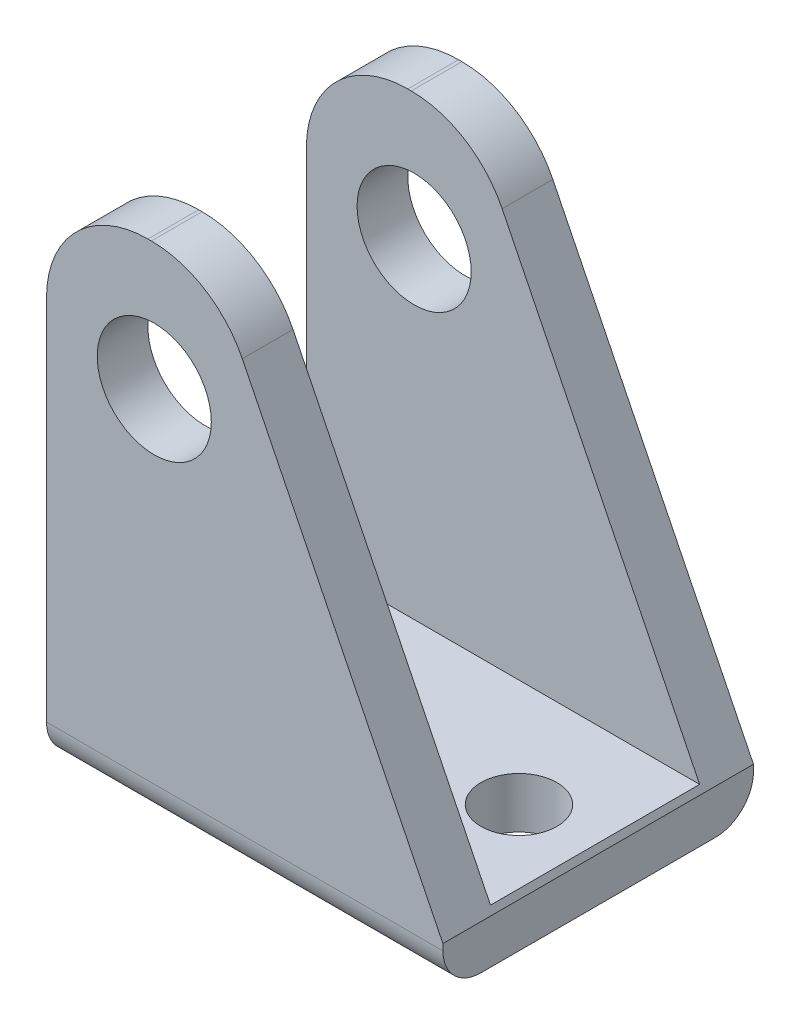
from build123d import *

# Parameters (mm, degrees)
EXTRUSION1_DEPTH        = 24.5
CONG_1_R                = 8
CONG_2_R                = 3
ESQUISSE3_R             = 4.5
ENL_V_MAT_EXTRU_1_DEPTH = 58.351983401
ESQUISSE4_W             = 36.682222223
ESQUISSE4_H             = 16.5
ENL_V_MAT_EXTRU_2_DEPTH = 36
ESQUISSE5_W             = 2.984444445
ESQUISSE5_H             = 26.595555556
ENL_V_MAT_EXTRU_3_DEPTH = 36
ESQUISSE6_R             = 3
ENL_V_MAT_EXTRU_4_DEPTH = 36


with BuildPart() as part:
    # Esquisse1 → Extrusion1 (new body)
    with BuildSketch(Plane.XY):
        Polygon((0, 0), (0, 40), (13.24362963, 40), (33, 0), align=None)
    extrude(amount=EXTRUSION1_DEPTH)

    # Cong_1
    cong_1_edges = [part.edges().sort_by_distance(p)[0] for p in [
        (0, 40, 12.25),
        (13.24362963, 40, 12.25),
    ]]
    fillet(cong_1_edges, radius=CONG_1_R)

    # Cong_2
    cong_2_edges = [part.edges().sort_by_distance(p)[0] for p in [
        (16.5, 0, 24.5),
        (16.5, 0, 0),
    ]]
    fillet(cong_2_edges, radius=CONG_2_R)

    # Esquisse3 → Enl_v. mat.-Extru.1 (cut, through all)
    with BuildSketch(Plane.XY.offset(24.5)):
        with Locations((8.5, 30)):
            Circle(ESQUISSE3_R)
    extrude(amount=-ENL_V_MAT_EXTRU_1_DEPTH, mode=Mode.SUBTRACT)

    # Esquisse4 → Enl_v. mat.-Extru.2 (cut)
    with BuildSketch(Plane(origin=(0, 40, 0), x_dir=(1, 0, 0), z_dir=(0, 1, 0))):
        with Locations((16.405555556, -12.25)):
            Rectangle(ESQUISSE4_W, ESQUISSE4_H)
    extrude(amount=-ENL_V_MAT_EXTRU_2_DEPTH, mode=Mode.SUBTRACT)

    # Esquisse5 → Enl_v. mat.-Extru.3 (cut)
    with BuildSketch(Plane(origin=(0, 4, 0), x_dir=(1, 0, 0), z_dir=(0, 1, 0))):
        with Locations((32.763333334, -12.212222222)):
            Rectangle(ESQUISSE5_W, ESQUISSE5_H)
    extrude(amount=-ENL_V_MAT_EXTRU_3_DEPTH, mode=Mode.SUBTRACT)

    # Esquisse6 → Enl_v. mat.-Extru.4 (cut)
    with BuildSketch(Plane(origin=(0, 4, 0), x_dir=(1, 0, 0), z_dir=(0, 1, 0))):
        with Locations(Location((5.27, -12.5, 0), (0, 0, 270))):
            Circle(ESQUISSE6_R)
        with Locations(Location((25.27, -12.5, 0), (0, 0, 270))):
            Circle(ESQUISSE6_R)
    extrude(amount=-ENL_V_MAT_EXTRU_4_DEPTH, mode=Mode.SUBTRACT)


solid = part.part
